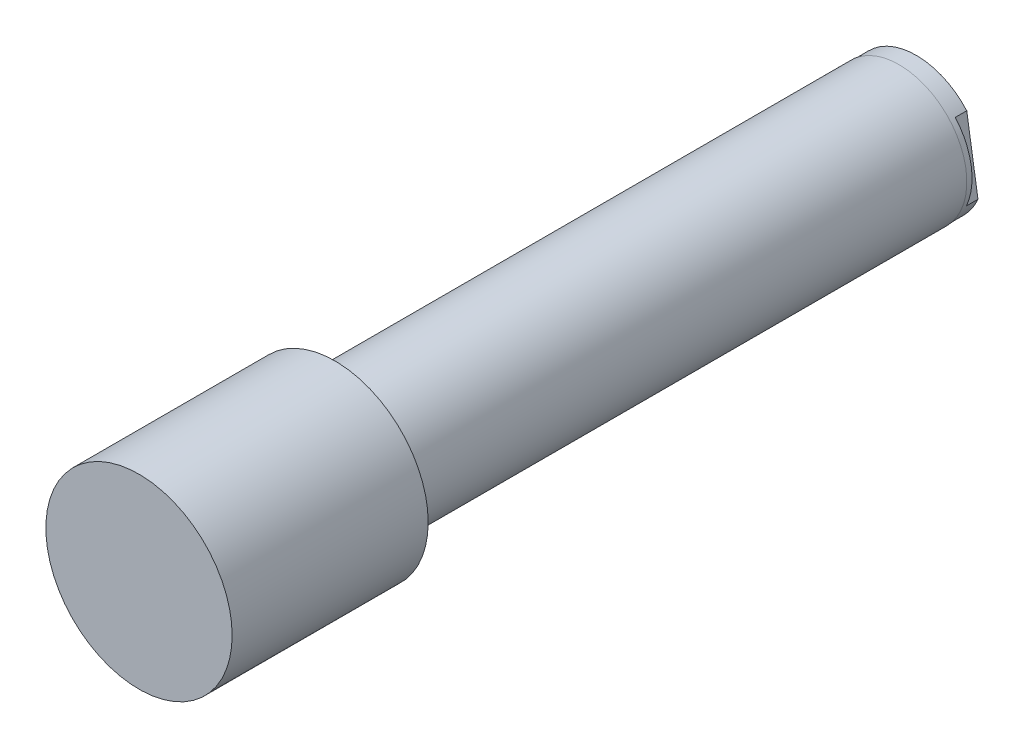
ISO-10303-21;
HEADER;
FILE_DESCRIPTION(('STEP AP214'),'2;1');
FILE_NAME('part.step','',(''),(''),'','','');
FILE_SCHEMA(('AUTOMOTIVE_DESIGN { 1 0 10303 214 1 1 1 1 }'));
ENDSEC;
DATA;
#1=APPLICATION_CONTEXT('core data for automotive mechanical design processes');
#2=APPLICATION_PROTOCOL_DEFINITION('international standard','automotive_design',2000,#1);
#3=PRODUCT_CONTEXT('',#1,'mechanical');
#4=PRODUCT('Part','Part','',(#3));
#5=PRODUCT_RELATED_PRODUCT_CATEGORY('part','',(#4));
#6=PRODUCT_DEFINITION_FORMATION('','',#4);
#7=PRODUCT_DEFINITION_CONTEXT('part definition',#1,'design');
#8=PRODUCT_DEFINITION('design','',#6,#7);
#9=PRODUCT_DEFINITION_SHAPE('','',#8);
#10=(LENGTH_UNIT() NAMED_UNIT(*) SI_UNIT(.MILLI.,.METRE.));
#11=(NAMED_UNIT(*) PLANE_ANGLE_UNIT() SI_UNIT($,.RADIAN.));
#12=(NAMED_UNIT(*) SI_UNIT($,.STERADIAN.) SOLID_ANGLE_UNIT());
#13=UNCERTAINTY_MEASURE_WITH_UNIT(LENGTH_MEASURE(1.E-05),#10,'distance_accuracy_value','');
#14=(GEOMETRIC_REPRESENTATION_CONTEXT(3) GLOBAL_UNCERTAINTY_ASSIGNED_CONTEXT((#13)) GLOBAL_UNIT_ASSIGNED_CONTEXT((#10,
#11,#12)) REPRESENTATION_CONTEXT('',''));
#15=CARTESIAN_POINT('',(0.,0.,0.));
#16=DIRECTION('',(0.,0.,1.));
#17=DIRECTION('',(1.,0.,0.));
#18=AXIS2_PLACEMENT_3D('',#15,#16,#17);
#19=CARTESIAN_POINT('',(0.,0.,33.7312));
#20=DIRECTION('',(0.,0.,-1.));
#21=DIRECTION('',(-1.,0.,0.));
#22=AXIS2_PLACEMENT_3D('',#19,#20,#21);
#23=CYLINDRICAL_SURFACE('',#22,4.96062);
#24=CARTESIAN_POINT('',(0.,0.,29.21));
#25=DIRECTION('',(0.,0.,-1.));
#26=DIRECTION('',(0.,1.,0.));
#27=AXIS2_PLACEMENT_3D('',#24,#25,#26);
#28=CIRCLE('',#27,4.96062);
#29=CARTESIAN_POINT('',(0.,4.96062,29.21));
#30=VERTEX_POINT('',#29);
#31=EDGE_CURVE('E25',#30,#30,#28,.T.);
#32=ORIENTED_EDGE('',*,*,#31,.F.);
#33=EDGE_LOOP('',(#32));
#34=FACE_BOUND('',#33,.T.);
#35=CARTESIAN_POINT('',(0.,0.,0.));
#36=DIRECTION('',(0.,0.,-1.));
#37=DIRECTION('',(0.156434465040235,-0.987688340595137,0.));
#38=AXIS2_PLACEMENT_3D('',#35,#36,#37);
#39=CIRCLE('',#38,4.96062);
#40=CARTESIAN_POINT('',(0.776011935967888,-4.89954653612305,0.));
#41=VERTEX_POINT('',#40);
#42=EDGE_CURVE('E76',#41,#41,#39,.T.);
#43=ORIENTED_EDGE('',*,*,#42,.T.);
#44=EDGE_LOOP('',(#43));
#45=FACE_BOUND('',#44,.T.);
#46=ADVANCED_FACE('F16',(#34,#45),#23,.F.);
#47=CARTESIAN_POINT('',(0.,0.,172.212));
#48=DIRECTION('',(0.,0.,1.));
#49=DIRECTION('',(1.,0.,0.));
#50=AXIS2_PLACEMENT_3D('',#47,#48,#49);
#51=PLANE('',#50);
#52=CARTESIAN_POINT('',(0.,0.,172.212));
#53=DIRECTION('',(0.,0.,1.));
#54=DIRECTION('',(1.,0.,0.));
#55=AXIS2_PLACEMENT_3D('',#52,#53,#54);
#56=CIRCLE('',#55,20.6375);
#57=CARTESIAN_POINT('',(20.6375,0.,172.212));
#58=VERTEX_POINT('',#57);
#59=EDGE_CURVE('E107',#58,#58,#56,.T.);
#60=ORIENTED_EDGE('',*,*,#59,.T.);
#61=EDGE_LOOP('',(#60));
#62=FACE_BOUND('',#61,.T.);
#63=ADVANCED_FACE('F132',(#62),#51,.T.);
#64=CARTESIAN_POINT('',(0.,0.,172.212));
#65=DIRECTION('',(0.,0.,-1.));
#66=DIRECTION('',(-1.,0.,0.));
#67=AXIS2_PLACEMENT_3D('',#64,#65,#66);
#68=CYLINDRICAL_SURFACE('',#67,20.6375);
#69=ORIENTED_EDGE('',*,*,#59,.F.);
#70=EDGE_LOOP('',(#69));
#71=FACE_BOUND('',#70,.T.);
#72=CARTESIAN_POINT('',(0.,0.,128.778));
#73=DIRECTION('',(0.,0.,1.));
#74=DIRECTION('',(1.,0.,0.));
#75=AXIS2_PLACEMENT_3D('',#72,#73,#74);
#76=CIRCLE('',#75,20.6375);
#77=CARTESIAN_POINT('',(20.6375,0.,128.778));
#78=VERTEX_POINT('',#77);
#79=EDGE_CURVE('E105',#78,#78,#76,.T.);
#80=ORIENTED_EDGE('',*,*,#79,.T.);
#81=EDGE_LOOP('',(#80));
#82=FACE_BOUND('',#81,.T.);
#83=ADVANCED_FACE('F121',(#71,#82),#68,.T.);
#84=CARTESIAN_POINT('',(0.,0.,128.778));
#85=DIRECTION('',(0.,0.,1.));
#86=DIRECTION('',(1.,0.,0.));
#87=AXIS2_PLACEMENT_3D('',#84,#85,#86);
#88=PLANE('',#87);
#89=CARTESIAN_POINT('',(0.,0.,128.778));
#90=DIRECTION('',(0.,0.,1.));
#91=DIRECTION('',(1.,0.,0.));
#92=AXIS2_PLACEMENT_3D('',#89,#90,#91);
#93=CIRCLE('',#92,14.9987);
#94=CARTESIAN_POINT('',(14.9987,0.,128.778));
#95=VERTEX_POINT('',#94);
#96=EDGE_CURVE('E72',#95,#95,#93,.F.);
#97=ORIENTED_EDGE('',*,*,#96,.F.);
#98=EDGE_LOOP('',(#97));
#99=FACE_BOUND('',#98,.T.);
#100=ORIENTED_EDGE('',*,*,#79,.F.);
#101=EDGE_LOOP('',(#100));
#102=FACE_BOUND('',#101,.T.);
#103=ADVANCED_FACE('F118',(#99,#102),#88,.F.);
#104=CARTESIAN_POINT('',(0.,0.,128.778));
#105=DIRECTION('',(0.,0.,-1.));
#106=DIRECTION('',(-1.,0.,0.));
#107=AXIS2_PLACEMENT_3D('',#104,#105,#106);
#108=CYLINDRICAL_SURFACE('',#107,14.9987);
#109=CARTESIAN_POINT('',(0.,0.,3.81));
#110=DIRECTION('',(0.,0.,-1.));
#111=DIRECTION('',(-1.,0.,0.));
#112=AXIS2_PLACEMENT_3D('',#109,#110,#111);
#113=CIRCLE('',#112,14.9987);
#114=CARTESIAN_POINT('',(-14.9987,0.,3.81));
#115=VERTEX_POINT('',#114);
#116=EDGE_CURVE('E69',#115,#115,#113,.T.);
#117=ORIENTED_EDGE('',*,*,#116,.F.);
#118=EDGE_LOOP('',(#117));
#119=FACE_BOUND('',#118,.T.);
#120=ORIENTED_EDGE('',*,*,#96,.T.);
#121=EDGE_LOOP('',(#120));
#122=FACE_BOUND('',#121,.T.);
#123=ADVANCED_FACE('F116',(#119,#122),#108,.T.);
#124=CARTESIAN_POINT('',(0.,0.,3.81));
#125=DIRECTION('',(0.,0.,-1.));
#126=DIRECTION('',(-1.,0.,0.));
#127=AXIS2_PLACEMENT_3D('',#124,#125,#126);
#128=PLANE('',#127);
#129=CARTESIAN_POINT('',(0.,0.,3.81));
#130=DIRECTION('',(0.,0.,-1.));
#131=DIRECTION('',(0.,1.,0.));
#132=AXIS2_PLACEMENT_3D('',#129,#130,#131);
#133=CIRCLE('',#132,14.8844);
#134=CARTESIAN_POINT('',(0.,14.8844,3.81));
#135=VERTEX_POINT('',#134);
#136=EDGE_CURVE('E10',#135,#135,#133,.T.);
#137=ORIENTED_EDGE('',*,*,#136,.F.);
#138=EDGE_LOOP('',(#137));
#139=FACE_BOUND('',#138,.T.);
#140=ORIENTED_EDGE('',*,*,#116,.T.);
#141=EDGE_LOOP('',(#140));
#142=FACE_BOUND('',#141,.T.);
#143=ADVANCED_FACE('F129',(#139,#142),#128,.T.);
#144=CARTESIAN_POINT('',(0.,0.,2.54));
#145=DIRECTION('',(0.,0.,-1.));
#146=DIRECTION('',(0.156434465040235,-0.987688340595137,0.));
#147=AXIS2_PLACEMENT_3D('',#144,#145,#146);
#148=PLANE('',#147);
#149=DIRECTION('',(0.156434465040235,-0.987688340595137,0.));
#150=VECTOR('',#149,1.);
#151=CARTESIAN_POINT('',(11.1719712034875,9.83526424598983,2.54));
#152=LINE('',#151,#150);
#153=CARTESIAN_POINT('',(11.1719712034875,9.83526424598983,2.54));
#154=VERTEX_POINT('',#153);
#155=CARTESIAN_POINT('',(13.6644398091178,-5.90156318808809,2.54));
#156=VERTEX_POINT('',#155);
#157=EDGE_CURVE('E80',#154,#156,#152,.T.);
#158=ORIENTED_EDGE('',*,*,#157,.F.);
#159=CARTESIAN_POINT('',(0.,0.,2.54));
#160=DIRECTION('',(0.,0.,-1.));
#161=DIRECTION('',(0.156434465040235,-0.987688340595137,0.));
#162=AXIS2_PLACEMENT_3D('',#159,#160,#161);
#163=CIRCLE('',#162,14.8844);
#164=EDGE_CURVE('E20',#156,#154,#163,.F.);
#165=ORIENTED_EDGE('',*,*,#164,.F.);
#166=EDGE_LOOP('',(#158,#165));
#167=FACE_BOUND('',#166,.T.);
#168=ADVANCED_FACE('F139',(#167),#148,.T.);
#169=CARTESIAN_POINT('',(11.1719712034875,9.83526424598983,2.54));
#170=DIRECTION('',(0.987688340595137,0.156434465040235,0.));
#171=DIRECTION('',(0.,0.,1.));
#172=AXIS2_PLACEMENT_3D('',#169,#170,#171);
#173=PLANE('',#172);
#174=DIRECTION('',(0.156434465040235,-0.987688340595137,0.));
#175=VECTOR('',#174,1.);
#176=CARTESIAN_POINT('',(11.1719712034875,9.83526424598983,0.));
#177=LINE('',#176,#175);
#178=CARTESIAN_POINT('',(11.1719712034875,9.83526424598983,0.));
#179=VERTEX_POINT('',#178);
#180=CARTESIAN_POINT('',(13.6644398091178,-5.90156318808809,0.));
#181=VERTEX_POINT('',#180);
#182=EDGE_CURVE('E79',#179,#181,#177,.T.);
#183=ORIENTED_EDGE('',*,*,#182,.F.);
#184=DIRECTION('',(0.,0.,-1.));
#185=VECTOR('',#184,1.);
#186=CARTESIAN_POINT('',(11.1719712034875,9.83526424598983,2.54));
#187=LINE('',#186,#185);
#188=EDGE_CURVE('E85',#154,#179,#187,.T.);
#189=ORIENTED_EDGE('',*,*,#188,.F.);
#190=ORIENTED_EDGE('',*,*,#157,.T.);
#191=DIRECTION('',(0.,0.,-1.));
#192=VECTOR('',#191,1.);
#193=CARTESIAN_POINT('',(13.6644398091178,-5.90156318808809,2.54));
#194=LINE('',#193,#192);
#195=EDGE_CURVE('E33',#156,#181,#194,.T.);
#196=ORIENTED_EDGE('',*,*,#195,.T.);
#197=EDGE_LOOP('',(#183,#189,#190,#196));
#198=FACE_BOUND('',#197,.T.);
#199=ADVANCED_FACE('F147',(#198),#173,.T.);
#200=DIRECTION('',(-0.156434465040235,0.987688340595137,0.));
#201=VECTOR('',#200,1.);
#202=CARTESIAN_POINT('',(-13.6644398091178,5.90156318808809,2.54));
#203=LINE('',#202,#201);
#204=CARTESIAN_POINT('',(-11.1719712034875,-9.83526424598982,2.54));
#205=VERTEX_POINT('',#204);
#206=CARTESIAN_POINT('',(-13.6644398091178,5.90156318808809,2.54));
#207=VERTEX_POINT('',#206);
#208=EDGE_CURVE('E82',#205,#207,#203,.T.);
#209=ORIENTED_EDGE('',*,*,#208,.F.);
#210=EDGE_CURVE('E100',#207,#205,#163,.F.);
#211=ORIENTED_EDGE('',*,*,#210,.F.);
#212=EDGE_LOOP('',(#209,#211));
#213=FACE_BOUND('',#212,.T.);
#214=ADVANCED_FACE('F146',(#213),#148,.T.);
#215=CARTESIAN_POINT('',(-13.6644398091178,5.90156318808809,2.54));
#216=DIRECTION('',(-0.987688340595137,-0.156434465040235,0.));
#217=DIRECTION('',(0.,0.,-1.));
#218=AXIS2_PLACEMENT_3D('',#215,#216,#217);
#219=PLANE('',#218);
#220=DIRECTION('',(-0.156434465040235,0.987688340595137,0.));
#221=VECTOR('',#220,1.);
#222=CARTESIAN_POINT('',(-13.6644398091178,5.90156318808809,0.));
#223=LINE('',#222,#221);
#224=CARTESIAN_POINT('',(-11.1719712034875,-9.83526424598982,0.));
#225=VERTEX_POINT('',#224);
#226=CARTESIAN_POINT('',(-13.6644398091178,5.90156318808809,0.));
#227=VERTEX_POINT('',#226);
#228=EDGE_CURVE('E83',#225,#227,#223,.T.);
#229=ORIENTED_EDGE('',*,*,#228,.F.);
#230=DIRECTION('',(0.,0.,-1.));
#231=VECTOR('',#230,1.);
#232=CARTESIAN_POINT('',(-11.1719712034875,-9.83526424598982,2.54));
#233=LINE('',#232,#231);
#234=EDGE_CURVE('E90',#205,#225,#233,.T.);
#235=ORIENTED_EDGE('',*,*,#234,.F.);
#236=ORIENTED_EDGE('',*,*,#208,.T.);
#237=DIRECTION('',(0.,0.,-1.));
#238=VECTOR('',#237,1.);
#239=CARTESIAN_POINT('',(-13.6644398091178,5.90156318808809,2.54));
#240=LINE('',#239,#238);
#241=EDGE_CURVE('E41',#207,#227,#240,.T.);
#242=ORIENTED_EDGE('',*,*,#241,.T.);
#243=EDGE_LOOP('',(#229,#235,#236,#242));
#244=FACE_BOUND('',#243,.T.);
#245=ADVANCED_FACE('F142',(#244),#219,.T.);
#246=CARTESIAN_POINT('',(0.,0.,0.));
#247=DIRECTION('',(0.,0.,-1.));
#248=DIRECTION('',(0.156434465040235,-0.987688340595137,0.));
#249=AXIS2_PLACEMENT_3D('',#246,#247,#248);
#250=PLANE('',#249);
#251=ORIENTED_EDGE('',*,*,#42,.F.);
#252=EDGE_LOOP('',(#251));
#253=FACE_BOUND('',#252,.T.);
#254=CARTESIAN_POINT('',(0.,0.,0.));
#255=DIRECTION('',(0.,0.,-1.));
#256=DIRECTION('',(0.156434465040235,-0.987688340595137,0.));
#257=AXIS2_PLACEMENT_3D('',#254,#255,#256);
#258=CIRCLE('',#257,14.8844);
#259=EDGE_CURVE('E89',#181,#225,#258,.T.);
#260=ORIENTED_EDGE('',*,*,#259,.T.);
#261=ORIENTED_EDGE('',*,*,#228,.T.);
#262=EDGE_CURVE('E96',#227,#179,#258,.T.);
#263=ORIENTED_EDGE('',*,*,#262,.T.);
#264=ORIENTED_EDGE('',*,*,#182,.T.);
#265=EDGE_LOOP('',(#260,#261,#263,#264));
#266=FACE_BOUND('',#265,.T.);
#267=ADVANCED_FACE('F145',(#253,#266),#250,.T.);
#268=CARTESIAN_POINT('',(0.,0.,2.54));
#269=DIRECTION('',(0.,0.,-1.));
#270=DIRECTION('',(0.156434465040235,-0.987688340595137,0.));
#271=AXIS2_PLACEMENT_3D('',#268,#269,#270);
#272=CYLINDRICAL_SURFACE('',#271,14.8844);
#273=ORIENTED_EDGE('',*,*,#262,.F.);
#274=ORIENTED_EDGE('',*,*,#241,.F.);
#275=ORIENTED_EDGE('',*,*,#210,.T.);
#276=ORIENTED_EDGE('',*,*,#234,.T.);
#277=ORIENTED_EDGE('',*,*,#259,.F.);
#278=ORIENTED_EDGE('',*,*,#195,.F.);
#279=ORIENTED_EDGE('',*,*,#164,.T.);
#280=ORIENTED_EDGE('',*,*,#188,.T.);
#281=EDGE_LOOP('',(#273,#274,#275,#276,#277,#278,#279,#280));
#282=FACE_BOUND('',#281,.T.);
#283=ORIENTED_EDGE('',*,*,#136,.T.);
#284=EDGE_LOOP('',(#283));
#285=FACE_BOUND('',#284,.T.);
#286=ADVANCED_FACE('F18',(#282,#285),#272,.T.);
#287=CARTESIAN_POINT('',(0.,0.,29.21));
#288=DIRECTION('',(0.,0.,-1.));
#289=DIRECTION('',(0.156434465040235,-0.987688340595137,0.));
#290=AXIS2_PLACEMENT_3D('',#287,#288,#289);
#291=CONICAL_SURFACE('',#290,4.96062,1.02974425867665);
#292=CARTESIAN_POINT('',(0.,0.,32.1906412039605));
#293=VERTEX_POINT('',#292);
#294=VERTEX_LOOP('',#293);
#295=FACE_BOUND('',#294,.T.);
#296=ORIENTED_EDGE('',*,*,#31,.T.);
#297=EDGE_LOOP('',(#296));
#298=FACE_BOUND('',#297,.T.);
#299=ADVANCED_FACE('F62',(#295,#298),#291,.F.);
#300=CLOSED_SHELL('',(#46,#63,#83,#103,#123,#143,#168,#199,#214,#245,#267,#286,#299));
#301=MANIFOLD_SOLID_BREP('B1',#300);
#302=ADVANCED_BREP_SHAPE_REPRESENTATION('',(#18,#301),#14);
#303=SHAPE_DEFINITION_REPRESENTATION(#9,#302);
ENDSEC;
END-ISO-10303-21;
